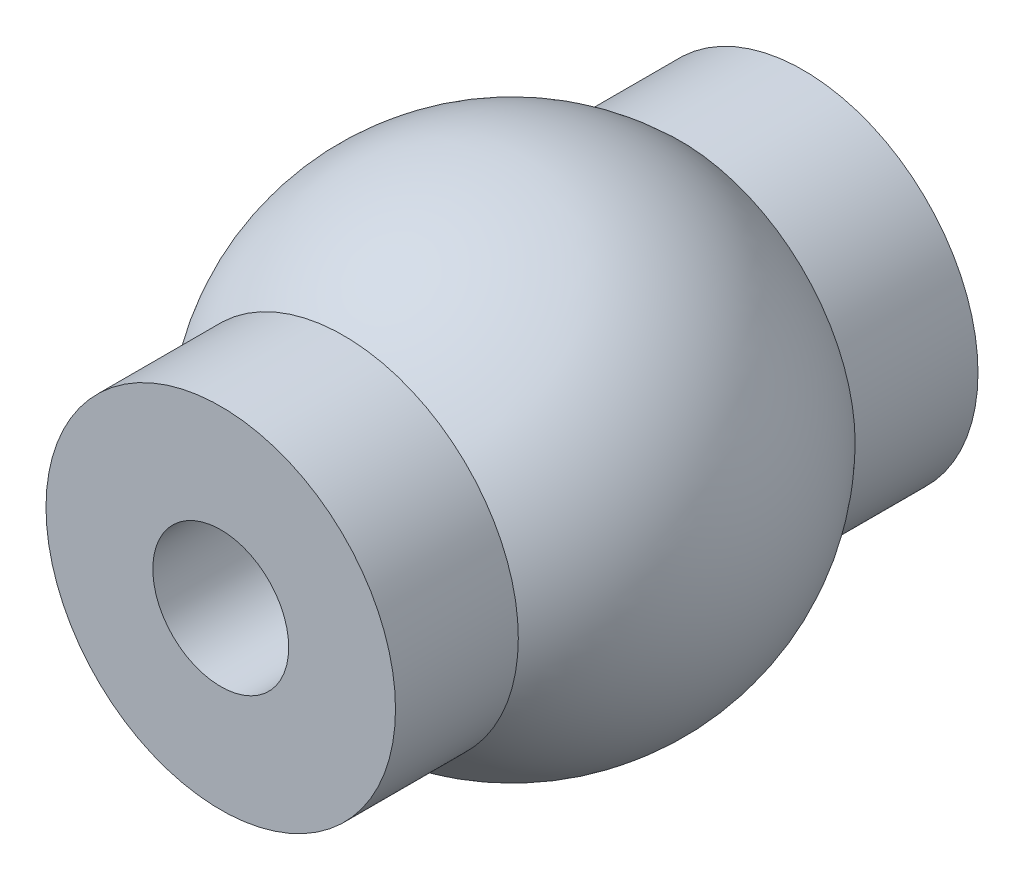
ISO-10303-21;
HEADER;
FILE_DESCRIPTION(('STEP AP214'),'2;1');
FILE_NAME('part.step','',(''),(''),'','','');
FILE_SCHEMA(('AUTOMOTIVE_DESIGN { 1 0 10303 214 1 1 1 1 }'));
ENDSEC;
DATA;
#1=APPLICATION_CONTEXT('core data for automotive mechanical design processes');
#2=APPLICATION_PROTOCOL_DEFINITION('international standard','automotive_design',2000,#1);
#3=PRODUCT_CONTEXT('',#1,'mechanical');
#4=PRODUCT('Part','Part','',(#3));
#5=PRODUCT_RELATED_PRODUCT_CATEGORY('part','',(#4));
#6=PRODUCT_DEFINITION_FORMATION('','',#4);
#7=PRODUCT_DEFINITION_CONTEXT('part definition',#1,'design');
#8=PRODUCT_DEFINITION('design','',#6,#7);
#9=PRODUCT_DEFINITION_SHAPE('','',#8);
#10=(LENGTH_UNIT() NAMED_UNIT(*) SI_UNIT(.MILLI.,.METRE.));
#11=(NAMED_UNIT(*) PLANE_ANGLE_UNIT() SI_UNIT($,.RADIAN.));
#12=(NAMED_UNIT(*) SI_UNIT($,.STERADIAN.) SOLID_ANGLE_UNIT());
#13=UNCERTAINTY_MEASURE_WITH_UNIT(LENGTH_MEASURE(1.E-05),#10,'distance_accuracy_value','');
#14=(GEOMETRIC_REPRESENTATION_CONTEXT(3) GLOBAL_UNCERTAINTY_ASSIGNED_CONTEXT((#13)) GLOBAL_UNIT_ASSIGNED_CONTEXT((#10,
#11,#12)) REPRESENTATION_CONTEXT('',''));
#15=CARTESIAN_POINT('',(0.,0.,0.));
#16=DIRECTION('',(0.,0.,1.));
#17=DIRECTION('',(1.,0.,0.));
#18=AXIS2_PLACEMENT_3D('',#15,#16,#17);
#19=CARTESIAN_POINT('',(0.,0.,0.));
#20=DIRECTION('',(0.,1.,0.));
#21=DIRECTION('',(1.,0.,0.));
#22=AXIS2_PLACEMENT_3D('',#19,#20,#21);
#23=SPHERICAL_SURFACE('',#22,12.5);
#24=CARTESIAN_POINT('',(0.,0.,0.));
#25=DIRECTION('',(0.,0.,-1.));
#26=DIRECTION('',(-1.,0.,0.));
#27=AXIS2_PLACEMENT_3D('',#24,#25,#26);
#28=SPHERICAL_SURFACE('',#27,12.5);
#29=CARTESIAN_POINT('',(0.,0.,8.67467578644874));
#30=DIRECTION('',(0.,0.,-1.));
#31=DIRECTION('',(-1.,0.,0.));
#32=AXIS2_PLACEMENT_3D('',#29,#30,#31);
#33=CIRCLE('',#32,9.);
#34=CARTESIAN_POINT('',(-9.,0.,8.67467578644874));
#35=VERTEX_POINT('',#34);
#36=EDGE_CURVE('E36',#35,#35,#33,.F.);
#37=ORIENTED_EDGE('',*,*,#36,.F.);
#38=EDGE_LOOP('',(#37));
#39=FACE_BOUND('',#38,.T.);
#40=CARTESIAN_POINT('',(0.,0.,-8.67467578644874));
#41=DIRECTION('',(0.,0.,1.));
#42=DIRECTION('',(1.,0.,0.));
#43=AXIS2_PLACEMENT_3D('',#40,#41,#42);
#44=CIRCLE('',#43,9.);
#45=CARTESIAN_POINT('',(9.,0.,-8.67467578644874));
#46=VERTEX_POINT('',#45);
#47=EDGE_CURVE('E10',#46,#46,#44,.F.);
#48=ORIENTED_EDGE('',*,*,#47,.F.);
#49=EDGE_LOOP('',(#48));
#50=FACE_BOUND('',#49,.T.);
#51=ADVANCED_FACE('F30',(#39,#50),#28,.T.);
#52=CARTESIAN_POINT('',(0.,0.,15.));
#53=DIRECTION('',(0.,0.,-1.));
#54=DIRECTION('',(-1.,0.,0.));
#55=AXIS2_PLACEMENT_3D('',#52,#53,#54);
#56=CYLINDRICAL_SURFACE('',#55,9.);
#57=CARTESIAN_POINT('',(0.,0.,15.));
#58=DIRECTION('',(0.,0.,1.));
#59=DIRECTION('',(1.,0.,0.));
#60=AXIS2_PLACEMENT_3D('',#57,#58,#59);
#61=CIRCLE('',#60,9.);
#62=CARTESIAN_POINT('',(9.,0.,15.));
#63=VERTEX_POINT('',#62);
#64=EDGE_CURVE('E40',#63,#63,#61,.T.);
#65=ORIENTED_EDGE('',*,*,#64,.F.);
#66=EDGE_LOOP('',(#65));
#67=FACE_BOUND('',#66,.T.);
#68=ORIENTED_EDGE('',*,*,#36,.T.);
#69=EDGE_LOOP('',(#68));
#70=FACE_BOUND('',#69,.T.);
#71=ADVANCED_FACE('F70',(#67,#70),#56,.T.);
#72=CARTESIAN_POINT('',(0.,0.,15.));
#73=DIRECTION('',(0.,0.,1.));
#74=DIRECTION('',(1.,0.,0.));
#75=AXIS2_PLACEMENT_3D('',#72,#73,#74);
#76=PLANE('',#75);
#77=ORIENTED_EDGE('',*,*,#64,.T.);
#78=EDGE_LOOP('',(#77));
#79=FACE_BOUND('',#78,.T.);
#80=CARTESIAN_POINT('',(0.,0.,15.));
#81=DIRECTION('',(0.,0.,1.));
#82=DIRECTION('',(1.,0.,0.));
#83=AXIS2_PLACEMENT_3D('',#80,#81,#82);
#84=CIRCLE('',#83,3.5);
#85=CARTESIAN_POINT('',(3.5,0.,15.));
#86=VERTEX_POINT('',#85);
#87=EDGE_CURVE('E44',#86,#86,#84,.T.);
#88=ORIENTED_EDGE('',*,*,#87,.F.);
#89=EDGE_LOOP('',(#88));
#90=FACE_BOUND('',#89,.T.);
#91=ADVANCED_FACE('F62',(#79,#90),#76,.T.);
#92=CARTESIAN_POINT('',(0.,0.,-30.));
#93=DIRECTION('',(0.,0.,1.));
#94=DIRECTION('',(1.,0.,0.));
#95=AXIS2_PLACEMENT_3D('',#92,#93,#94);
#96=CYLINDRICAL_SURFACE('',#95,3.5);
#97=ORIENTED_EDGE('',*,*,#87,.T.);
#98=EDGE_LOOP('',(#97));
#99=FACE_BOUND('',#98,.T.);
#100=CARTESIAN_POINT('',(0.,0.,-15.));
#101=DIRECTION('',(0.,0.,1.));
#102=DIRECTION('',(1.,0.,0.));
#103=AXIS2_PLACEMENT_3D('',#100,#101,#102);
#104=CIRCLE('',#103,3.5);
#105=CARTESIAN_POINT('',(3.5,0.,-15.));
#106=VERTEX_POINT('',#105);
#107=EDGE_CURVE('E52',#106,#106,#104,.T.);
#108=ORIENTED_EDGE('',*,*,#107,.F.);
#109=EDGE_LOOP('',(#108));
#110=FACE_BOUND('',#109,.T.);
#111=ADVANCED_FACE('F59',(#99,#110),#96,.F.);
#112=CARTESIAN_POINT('',(0.,0.,-15.));
#113=DIRECTION('',(0.,0.,1.));
#114=DIRECTION('',(1.,0.,0.));
#115=AXIS2_PLACEMENT_3D('',#112,#113,#114);
#116=CIRCLE('',#115,9.);
#117=CARTESIAN_POINT('',(9.,0.,-15.));
#118=VERTEX_POINT('',#117);
#119=EDGE_CURVE('E49',#118,#118,#116,.T.);
#120=ORIENTED_EDGE('',*,*,#119,.T.);
#121=EDGE_LOOP('',(#120));
#122=FACE_BOUND('',#121,.T.);
#123=ORIENTED_EDGE('',*,*,#47,.T.);
#124=EDGE_LOOP('',(#123));
#125=FACE_BOUND('',#124,.T.);
#126=ADVANCED_FACE('F61',(#122,#125),#56,.T.);
#127=CARTESIAN_POINT('',(0.,0.,-15.));
#128=DIRECTION('',(0.,0.,1.));
#129=DIRECTION('',(1.,0.,0.));
#130=AXIS2_PLACEMENT_3D('',#127,#128,#129);
#131=PLANE('',#130);
#132=ORIENTED_EDGE('',*,*,#107,.T.);
#133=EDGE_LOOP('',(#132));
#134=FACE_BOUND('',#133,.T.);
#135=ORIENTED_EDGE('',*,*,#119,.F.);
#136=EDGE_LOOP('',(#135));
#137=FACE_BOUND('',#136,.T.);
#138=ADVANCED_FACE('F56',(#134,#137),#131,.F.);
#139=CLOSED_SHELL('',(#51,#71,#91,#111,#126,#138));
#140=MANIFOLD_SOLID_BREP('B2',#139);
#141=ADVANCED_BREP_SHAPE_REPRESENTATION('',(#18,#140),#14);
#142=SHAPE_DEFINITION_REPRESENTATION(#9,#141);
ENDSEC;
END-ISO-10303-21;
